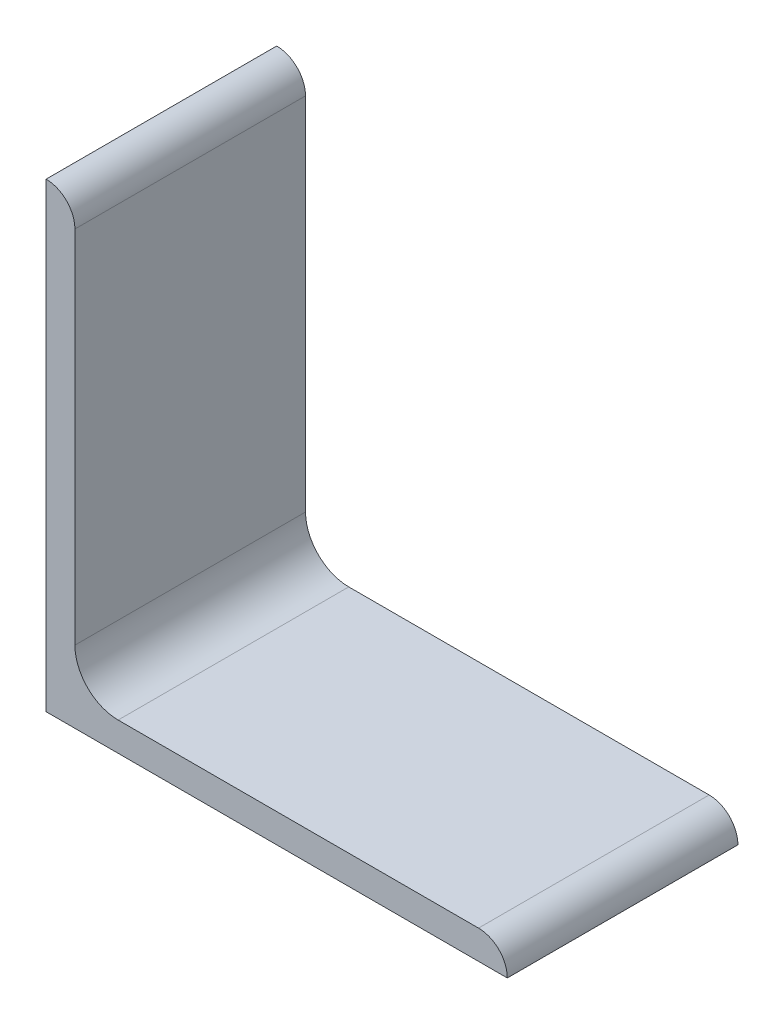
from build123d import *

# Parameters (mm, degrees)
BASESTEELANGLE_DEPTH = 12.7


with BuildPart() as part:
    # Sketch1 → BaseSteelAngle (new, symmetric)
    with BuildSketch(Plane.XY):
        with BuildLine():
            Line((0, 0), (0, 50.8))
            Line((0, 50.8), (0.00508, 50.8))
            ThreePointArc((0.00508, 50.8), (2.246551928, 49.871551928), (3.175, 47.63008))
            Line((3.175, 47.63008), (3.175, 7.9375))
            ThreePointArc((3.175, 7.9375), (4.569903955, 4.569903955), (7.9375, 3.175))
            Line((7.9375, 3.175), (47.63008, 3.175))
            ThreePointArc((47.63008, 3.175), (49.871551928, 2.246551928), (50.8, 0.00508))
            Line((50.8, 0.00508), (50.8, 0))
            Line((50.8, 0), (0, 0))
        make_face()
    extrude(amount=BASESTEELANGLE_DEPTH, both=True)


solid = part.part
